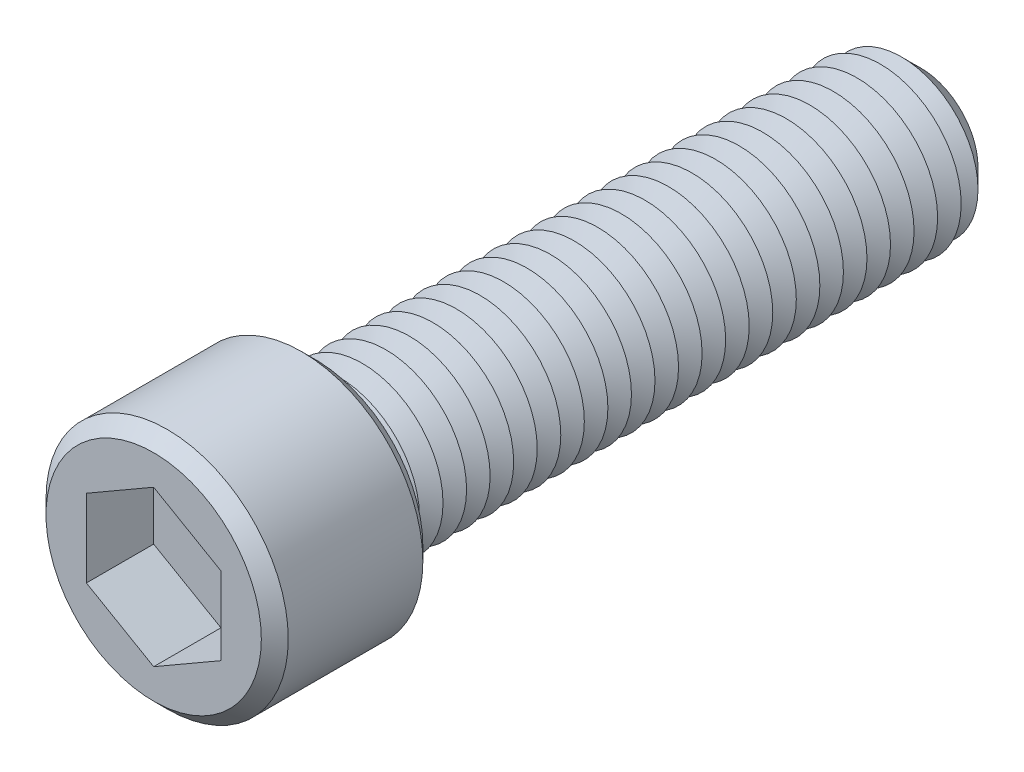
from build123d import *

# Parameters (mm, degrees)
SKETCH1_R           = 9
BOSS_EXTRUDE1_DEPTH = 12
SKETCH2_R           = 6
BOSS_EXTRUDE2_DEPTH = 45
CHAMFER1_SIZE       = 1.75
LPATTERN1_COUNT     = 25
LPATTERN1_PITCH     = 1.75
CUT_EXTRUDE1_DEPTH  = 5
SKETCH6_R           = 0.9
CUT_EXTRUDE2_DEPTH  = 52
CHAMFER2_SIZE       = 1


with BuildPart() as part:
    # Sketch1 → Boss-Extrude1 (new body)
    with BuildSketch(Plane.XY):
        Circle(SKETCH1_R)
    extrude(amount=BOSS_EXTRUDE1_DEPTH)

    # Sketch2 → Boss-Extrude2 (add)
    with BuildSketch(Plane(origin=(0, 0, 0), x_dir=(-1, 0, 0), z_dir=(0, 0, -1))):
        with Locations(Location((0, 0, 0), (0, 0, 180))):
            Circle(SKETCH2_R)
    extrude(amount=BOSS_EXTRUDE2_DEPTH)

    # Chamfer1
    chamfer1_edges = [part.edges().sort_by_distance(p)[0] for p in [
        (-6, 0, -45),
    ]]
    chamfer(chamfer1_edges, length=CHAMFER1_SIZE)

    # Sketch4 → Cut-Revolve1 (revolve, cut)
    with BuildSketch(Plane(origin=(0, 0, 0), x_dir=(0, 0, -1), z_dir=(1, 0, 0)), mode=Mode.PRIVATE) as cut_revolve1_sk:
        Polygon((0, 6), (0.875, 4.484455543), (1.75, 6), align=None)
    cut_revolve1 = revolve(cut_revolve1_sk.sketch.rotate(Axis((0, 0, 2.512122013), (0, 0, -1)), 90), axis=Axis((0, 0, 2.512122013), (0, 0, -1)), mode=Mode.SUBTRACT)

    # LPattern1: Cut-Revolve1 ×25
    with Locations(*[(0, 0, -i * LPATTERN1_PITCH) for i in range(1, LPATTERN1_COUNT)]):
        add(cut_revolve1, mode=Mode.SUBTRACT)

    # Sketch5 → Cut-Extrude1 (cut)
    with BuildSketch(Plane.XY.offset(12)):
        Polygon((0, 5.773502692), (-5, 2.886751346), (-5, -2.886751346), (0, -5.773502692), (5, -2.886751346), (5, 2.886751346), align=None)
    extrude(amount=-CUT_EXTRUDE1_DEPTH, mode=Mode.SUBTRACT)

    # Sketch6 → Cut-Extrude2 (cut)
    with BuildSketch(Plane.XY.offset(7)):
        Circle(SKETCH6_R)
    extrude(amount=-CUT_EXTRUDE2_DEPTH, mode=Mode.SUBTRACT)

    # Chamfer2
    chamfer2_edges = [part.edges().sort_by_distance(p)[0] for p in [
        (-9, 0, 0),
        (-9, 0, 12),
    ]]
    chamfer(chamfer2_edges, length=CHAMFER2_SIZE)


solid = part.part
